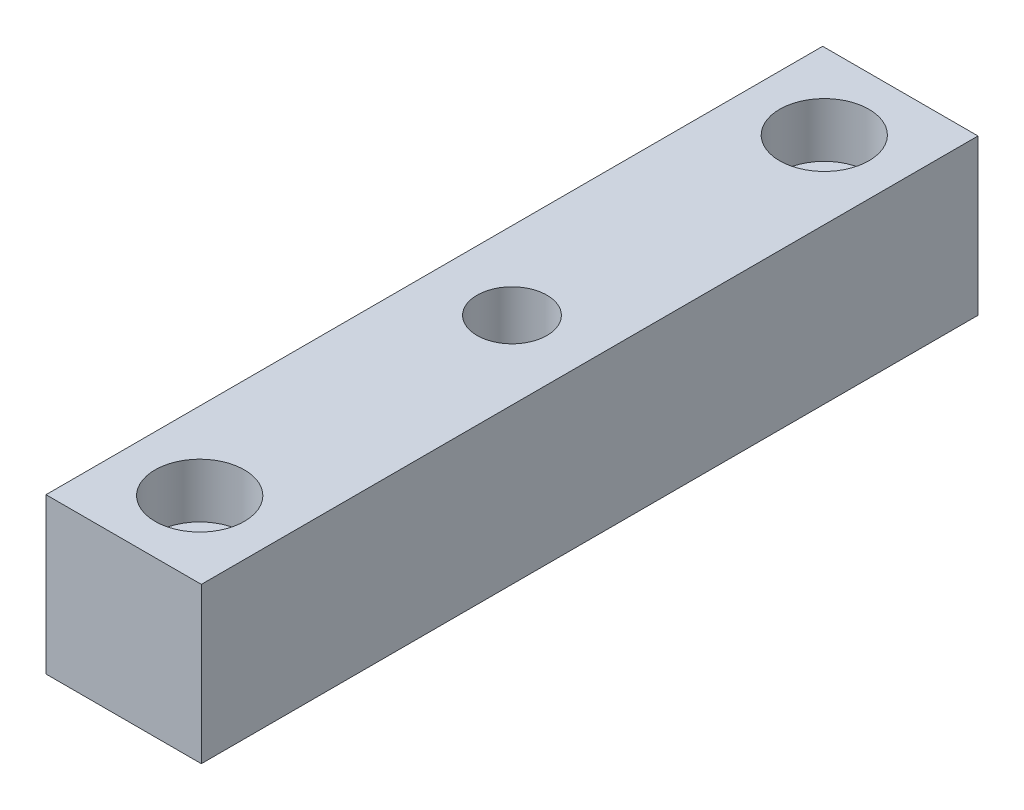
ISO-10303-21;
HEADER;
FILE_DESCRIPTION(('STEP AP214'),'2;1');
FILE_NAME('part.step','',(''),(''),'','','');
FILE_SCHEMA(('AUTOMOTIVE_DESIGN { 1 0 10303 214 1 1 1 1 }'));
ENDSEC;
DATA;
#1=APPLICATION_CONTEXT('core data for automotive mechanical design processes');
#2=APPLICATION_PROTOCOL_DEFINITION('international standard','automotive_design',2000,#1);
#3=PRODUCT_CONTEXT('',#1,'mechanical');
#4=PRODUCT('Part','Part','',(#3));
#5=PRODUCT_RELATED_PRODUCT_CATEGORY('part','',(#4));
#6=PRODUCT_DEFINITION_FORMATION('','',#4);
#7=PRODUCT_DEFINITION_CONTEXT('part definition',#1,'design');
#8=PRODUCT_DEFINITION('design','',#6,#7);
#9=PRODUCT_DEFINITION_SHAPE('','',#8);
#10=(LENGTH_UNIT() NAMED_UNIT(*) SI_UNIT(.MILLI.,.METRE.));
#11=(NAMED_UNIT(*) PLANE_ANGLE_UNIT() SI_UNIT($,.RADIAN.));
#12=(NAMED_UNIT(*) SI_UNIT($,.STERADIAN.) SOLID_ANGLE_UNIT());
#13=UNCERTAINTY_MEASURE_WITH_UNIT(LENGTH_MEASURE(1.E-05),#10,'distance_accuracy_value','');
#14=(GEOMETRIC_REPRESENTATION_CONTEXT(3) GLOBAL_UNCERTAINTY_ASSIGNED_CONTEXT((#13)) GLOBAL_UNIT_ASSIGNED_CONTEXT((#10,
#11,#12)) REPRESENTATION_CONTEXT('',''));
#15=CARTESIAN_POINT('',(0.,0.,0.));
#16=DIRECTION('',(0.,0.,1.));
#17=DIRECTION('',(1.,0.,0.));
#18=AXIS2_PLACEMENT_3D('',#15,#16,#17);
#19=CARTESIAN_POINT('',(-20.,20.,100.));
#20=DIRECTION('',(1.,0.,0.));
#21=DIRECTION('',(0.,1.,0.));
#22=AXIS2_PLACEMENT_3D('',#19,#20,#21);
#23=PLANE('',#22);
#24=DIRECTION('',(0.,-1.,0.));
#25=VECTOR('',#24,1.);
#26=CARTESIAN_POINT('',(-20.,20.,-100.));
#27=LINE('',#26,#25);
#28=CARTESIAN_POINT('',(-20.,20.,-100.));
#29=VERTEX_POINT('',#28);
#30=CARTESIAN_POINT('',(-20.,-20.,-100.));
#31=VERTEX_POINT('',#30);
#32=EDGE_CURVE('E90',#29,#31,#27,.T.);
#33=ORIENTED_EDGE('',*,*,#32,.T.);
#34=DIRECTION('',(0.,0.,-1.));
#35=VECTOR('',#34,1.);
#36=CARTESIAN_POINT('',(-20.,-20.,100.));
#37=LINE('',#36,#35);
#38=CARTESIAN_POINT('',(-20.,-20.,100.));
#39=VERTEX_POINT('',#38);
#40=EDGE_CURVE('E11',#39,#31,#37,.T.);
#41=ORIENTED_EDGE('',*,*,#40,.F.);
#42=DIRECTION('',(0.,-1.,0.));
#43=VECTOR('',#42,1.);
#44=CARTESIAN_POINT('',(-20.,20.,100.));
#45=LINE('',#44,#43);
#46=CARTESIAN_POINT('',(-20.,20.,100.));
#47=VERTEX_POINT('',#46);
#48=EDGE_CURVE('E105',#47,#39,#45,.T.);
#49=ORIENTED_EDGE('',*,*,#48,.F.);
#50=DIRECTION('',(0.,0.,-1.));
#51=VECTOR('',#50,1.);
#52=CARTESIAN_POINT('',(-20.,20.,100.));
#53=LINE('',#52,#51);
#54=EDGE_CURVE('E111',#47,#29,#53,.T.);
#55=ORIENTED_EDGE('',*,*,#54,.T.);
#56=EDGE_LOOP('',(#33,#41,#49,#55));
#57=FACE_BOUND('',#56,.T.);
#58=ADVANCED_FACE('F35',(#57),#23,.F.);
#59=CARTESIAN_POINT('',(-20.,-20.,100.));
#60=DIRECTION('',(0.,1.,0.));
#61=DIRECTION('',(0.,0.,1.));
#62=AXIS2_PLACEMENT_3D('',#59,#60,#61);
#63=PLANE('',#62);
#64=CARTESIAN_POINT('',(0.,-20.,80.415));
#65=DIRECTION('',(0.,1.,0.));
#66=DIRECTION('',(0.,0.,1.));
#67=AXIS2_PLACEMENT_3D('',#64,#65,#66);
#68=CIRCLE('',#67,7.99999999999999);
#69=CARTESIAN_POINT('',(0.,-20.,88.415));
#70=VERTEX_POINT('',#69);
#71=EDGE_CURVE('E178',#70,#70,#68,.T.);
#72=ORIENTED_EDGE('',*,*,#71,.T.);
#73=EDGE_LOOP('',(#72));
#74=FACE_BOUND('',#73,.T.);
#75=CARTESIAN_POINT('',(0.,-20.,-80.415));
#76=DIRECTION('',(0.,1.,0.));
#77=DIRECTION('',(0.,0.,1.));
#78=AXIS2_PLACEMENT_3D('',#75,#76,#77);
#79=CIRCLE('',#78,7.99999999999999);
#80=CARTESIAN_POINT('',(0.,-20.,-72.415));
#81=VERTEX_POINT('',#80);
#82=EDGE_CURVE('E191',#81,#81,#79,.T.);
#83=ORIENTED_EDGE('',*,*,#82,.T.);
#84=EDGE_LOOP('',(#83));
#85=FACE_BOUND('',#84,.T.);
#86=DIRECTION('',(1.,0.,0.));
#87=VECTOR('',#86,1.);
#88=CARTESIAN_POINT('',(-20.,-20.,-100.));
#89=LINE('',#88,#87);
#90=CARTESIAN_POINT('',(20.,-20.,-100.));
#91=VERTEX_POINT('',#90);
#92=EDGE_CURVE('E99',#31,#91,#89,.T.);
#93=ORIENTED_EDGE('',*,*,#92,.T.);
#94=DIRECTION('',(0.,0.,-1.));
#95=VECTOR('',#94,1.);
#96=CARTESIAN_POINT('',(20.,-20.,100.));
#97=LINE('',#96,#95);
#98=CARTESIAN_POINT('',(20.,-20.,100.));
#99=VERTEX_POINT('',#98);
#100=EDGE_CURVE('E42',#99,#91,#97,.T.);
#101=ORIENTED_EDGE('',*,*,#100,.F.);
#102=DIRECTION('',(1.,0.,0.));
#103=VECTOR('',#102,1.);
#104=CARTESIAN_POINT('',(-20.,-20.,100.));
#105=LINE('',#104,#103);
#106=EDGE_CURVE('E107',#39,#99,#105,.T.);
#107=ORIENTED_EDGE('',*,*,#106,.F.);
#108=ORIENTED_EDGE('',*,*,#40,.T.);
#109=EDGE_LOOP('',(#93,#101,#107,#108));
#110=FACE_BOUND('',#109,.T.);
#111=ADVANCED_FACE('F132',(#74,#85,#110),#63,.F.);
#112=CARTESIAN_POINT('',(20.,20.,100.));
#113=DIRECTION('',(-1.,0.,0.));
#114=DIRECTION('',(0.,-1.,0.));
#115=AXIS2_PLACEMENT_3D('',#112,#113,#114);
#116=PLANE('',#115);
#117=DIRECTION('',(0.,1.,0.));
#118=VECTOR('',#117,1.);
#119=CARTESIAN_POINT('',(20.,20.,-100.));
#120=LINE('',#119,#118);
#121=CARTESIAN_POINT('',(20.,20.,-100.));
#122=VERTEX_POINT('',#121);
#123=EDGE_CURVE('E101',#91,#122,#120,.T.);
#124=ORIENTED_EDGE('',*,*,#123,.T.);
#125=DIRECTION('',(0.,0.,-1.));
#126=VECTOR('',#125,1.);
#127=CARTESIAN_POINT('',(20.,20.,100.));
#128=LINE('',#127,#126);
#129=CARTESIAN_POINT('',(20.,20.,100.));
#130=VERTEX_POINT('',#129);
#131=EDGE_CURVE('E114',#130,#122,#128,.T.);
#132=ORIENTED_EDGE('',*,*,#131,.F.);
#133=DIRECTION('',(0.,1.,0.));
#134=VECTOR('',#133,1.);
#135=CARTESIAN_POINT('',(20.,20.,100.));
#136=LINE('',#135,#134);
#137=EDGE_CURVE('E54',#99,#130,#136,.T.);
#138=ORIENTED_EDGE('',*,*,#137,.F.);
#139=ORIENTED_EDGE('',*,*,#100,.T.);
#140=EDGE_LOOP('',(#124,#132,#138,#139));
#141=FACE_BOUND('',#140,.T.);
#142=ADVANCED_FACE('F120',(#141),#116,.F.);
#143=CARTESIAN_POINT('',(-20.,20.,100.));
#144=DIRECTION('',(0.,-1.,0.));
#145=DIRECTION('',(0.,0.,-1.));
#146=AXIS2_PLACEMENT_3D('',#143,#144,#145);
#147=PLANE('',#146);
#148=CARTESIAN_POINT('',(0.,20.,80.415));
#149=DIRECTION('',(0.,1.,0.));
#150=DIRECTION('',(0.,0.,1.));
#151=AXIS2_PLACEMENT_3D('',#148,#149,#150);
#152=CIRCLE('',#151,11.5);
#153=CARTESIAN_POINT('',(0.,20.,91.915));
#154=VERTEX_POINT('',#153);
#155=EDGE_CURVE('E185',#154,#154,#152,.T.);
#156=ORIENTED_EDGE('',*,*,#155,.F.);
#157=EDGE_LOOP('',(#156));
#158=FACE_BOUND('',#157,.T.);
#159=CARTESIAN_POINT('',(0.,20.,-80.415));
#160=DIRECTION('',(0.,1.,0.));
#161=DIRECTION('',(0.,0.,1.));
#162=AXIS2_PLACEMENT_3D('',#159,#160,#161);
#163=CIRCLE('',#162,11.5);
#164=CARTESIAN_POINT('',(0.,20.,-68.915));
#165=VERTEX_POINT('',#164);
#166=EDGE_CURVE('E87',#165,#165,#163,.T.);
#167=ORIENTED_EDGE('',*,*,#166,.F.);
#168=EDGE_LOOP('',(#167));
#169=FACE_BOUND('',#168,.T.);
#170=CARTESIAN_POINT('',(0.,20.,0.));
#171=DIRECTION('',(0.,1.,0.));
#172=DIRECTION('',(0.,0.,1.));
#173=AXIS2_PLACEMENT_3D('',#170,#171,#172);
#174=CIRCLE('',#173,9.);
#175=CARTESIAN_POINT('',(0.,20.,9.));
#176=VERTEX_POINT('',#175);
#177=EDGE_CURVE('E86',#176,#176,#174,.T.);
#178=ORIENTED_EDGE('',*,*,#177,.F.);
#179=EDGE_LOOP('',(#178));
#180=FACE_BOUND('',#179,.T.);
#181=DIRECTION('',(-1.,0.,0.));
#182=VECTOR('',#181,1.);
#183=CARTESIAN_POINT('',(-20.,20.,-100.));
#184=LINE('',#183,#182);
#185=EDGE_CURVE('E103',#122,#29,#184,.T.);
#186=ORIENTED_EDGE('',*,*,#185,.T.);
#187=ORIENTED_EDGE('',*,*,#54,.F.);
#188=DIRECTION('',(-1.,0.,0.));
#189=VECTOR('',#188,1.);
#190=CARTESIAN_POINT('',(-20.,20.,100.));
#191=LINE('',#190,#189);
#192=EDGE_CURVE('E49',#130,#47,#191,.T.);
#193=ORIENTED_EDGE('',*,*,#192,.F.);
#194=ORIENTED_EDGE('',*,*,#131,.T.);
#195=EDGE_LOOP('',(#186,#187,#193,#194));
#196=FACE_BOUND('',#195,.T.);
#197=ADVANCED_FACE('F127',(#158,#169,#180,#196),#147,.F.);
#198=CARTESIAN_POINT('',(-20.,-20.,100.));
#199=DIRECTION('',(0.,0.,1.));
#200=DIRECTION('',(1.,0.,0.));
#201=AXIS2_PLACEMENT_3D('',#198,#199,#200);
#202=PLANE('',#201);
#203=ORIENTED_EDGE('',*,*,#48,.T.);
#204=ORIENTED_EDGE('',*,*,#106,.T.);
#205=ORIENTED_EDGE('',*,*,#137,.T.);
#206=ORIENTED_EDGE('',*,*,#192,.T.);
#207=EDGE_LOOP('',(#203,#204,#205,#206));
#208=FACE_BOUND('',#207,.T.);
#209=ADVANCED_FACE('F131',(#208),#202,.T.);
#210=CARTESIAN_POINT('',(-20.,-20.,-100.));
#211=DIRECTION('',(0.,0.,1.));
#212=DIRECTION('',(1.,0.,0.));
#213=AXIS2_PLACEMENT_3D('',#210,#211,#212);
#214=PLANE('',#213);
#215=ORIENTED_EDGE('',*,*,#32,.F.);
#216=ORIENTED_EDGE('',*,*,#185,.F.);
#217=ORIENTED_EDGE('',*,*,#123,.F.);
#218=ORIENTED_EDGE('',*,*,#92,.F.);
#219=EDGE_LOOP('',(#215,#216,#217,#218));
#220=FACE_BOUND('',#219,.T.);
#221=ADVANCED_FACE('F125',(#220),#214,.F.);
#222=CARTESIAN_POINT('',(0.,20.,0.));
#223=DIRECTION('',(0.,1.,0.));
#224=DIRECTION('',(0.,0.,1.));
#225=AXIS2_PLACEMENT_3D('',#222,#223,#224);
#226=CYLINDRICAL_SURFACE('',#225,9.);
#227=CARTESIAN_POINT('',(0.,-13.,0.));
#228=DIRECTION('',(0.,1.,0.));
#229=DIRECTION('',(0.,0.,1.));
#230=AXIS2_PLACEMENT_3D('',#227,#228,#229);
#231=CIRCLE('',#230,8.99999999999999);
#232=CARTESIAN_POINT('',(0.,-13.,8.99999999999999));
#233=VERTEX_POINT('',#232);
#234=EDGE_CURVE('E84',#233,#233,#231,.T.);
#235=ORIENTED_EDGE('',*,*,#234,.F.);
#236=EDGE_LOOP('',(#235));
#237=FACE_BOUND('',#236,.T.);
#238=ORIENTED_EDGE('',*,*,#177,.T.);
#239=EDGE_LOOP('',(#238));
#240=FACE_BOUND('',#239,.T.);
#241=ADVANCED_FACE('F80',(#237,#240),#226,.F.);
#242=CARTESIAN_POINT('',(0.,-13.,0.));
#243=DIRECTION('',(0.,1.,0.));
#244=DIRECTION('',(0.,0.,1.));
#245=AXIS2_PLACEMENT_3D('',#242,#243,#244);
#246=CONICAL_SURFACE('',#245,8.99999999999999,1.0471975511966);
#247=CARTESIAN_POINT('',(0.,-18.1961524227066,0.));
#248=VERTEX_POINT('',#247);
#249=VERTEX_LOOP('',#248);
#250=FACE_BOUND('',#249,.T.);
#251=ORIENTED_EDGE('',*,*,#234,.T.);
#252=EDGE_LOOP('',(#251));
#253=FACE_BOUND('',#252,.T.);
#254=ADVANCED_FACE('F76',(#250,#253),#246,.F.);
#255=CARTESIAN_POINT('',(0.,20.,-80.415));
#256=DIRECTION('',(0.,1.,0.));
#257=DIRECTION('',(0.,0.,1.));
#258=AXIS2_PLACEMENT_3D('',#255,#256,#257);
#259=CYLINDRICAL_SURFACE('',#258,11.5);
#260=CARTESIAN_POINT('',(0.,6.,-80.415));
#261=DIRECTION('',(0.,1.,0.));
#262=DIRECTION('',(0.,0.,1.));
#263=AXIS2_PLACEMENT_3D('',#260,#261,#262);
#264=CIRCLE('',#263,11.5);
#265=CARTESIAN_POINT('',(0.,6.,-68.915));
#266=VERTEX_POINT('',#265);
#267=EDGE_CURVE('E93',#266,#266,#264,.T.);
#268=ORIENTED_EDGE('',*,*,#267,.F.);
#269=EDGE_LOOP('',(#268));
#270=FACE_BOUND('',#269,.T.);
#271=ORIENTED_EDGE('',*,*,#166,.T.);
#272=EDGE_LOOP('',(#271));
#273=FACE_BOUND('',#272,.T.);
#274=ADVANCED_FACE('F79',(#270,#273),#259,.F.);
#275=CARTESIAN_POINT('',(8.,6.,-80.415));
#276=DIRECTION('',(0.,-1.,0.));
#277=DIRECTION('',(0.,0.,-1.));
#278=AXIS2_PLACEMENT_3D('',#275,#276,#277);
#279=PLANE('',#278);
#280=CARTESIAN_POINT('',(0.,6.,-80.415));
#281=DIRECTION('',(0.,1.,0.));
#282=DIRECTION('',(0.,0.,1.));
#283=AXIS2_PLACEMENT_3D('',#280,#281,#282);
#284=CIRCLE('',#283,8.);
#285=CARTESIAN_POINT('',(0.,6.,-72.415));
#286=VERTEX_POINT('',#285);
#287=EDGE_CURVE('E194',#286,#286,#284,.T.);
#288=ORIENTED_EDGE('',*,*,#287,.F.);
#289=EDGE_LOOP('',(#288));
#290=FACE_BOUND('',#289,.T.);
#291=ORIENTED_EDGE('',*,*,#267,.T.);
#292=EDGE_LOOP('',(#291));
#293=FACE_BOUND('',#292,.T.);
#294=ADVANCED_FACE('F154',(#290,#293),#279,.F.);
#295=CARTESIAN_POINT('',(0.,20.,-80.415));
#296=DIRECTION('',(0.,1.,0.));
#297=DIRECTION('',(0.,0.,1.));
#298=AXIS2_PLACEMENT_3D('',#295,#296,#297);
#299=CYLINDRICAL_SURFACE('',#298,8.);
#300=ORIENTED_EDGE('',*,*,#82,.F.);
#301=EDGE_LOOP('',(#300));
#302=FACE_BOUND('',#301,.T.);
#303=ORIENTED_EDGE('',*,*,#287,.T.);
#304=EDGE_LOOP('',(#303));
#305=FACE_BOUND('',#304,.T.);
#306=ADVANCED_FACE('F158',(#302,#305),#299,.F.);
#307=CARTESIAN_POINT('',(0.,20.,80.415));
#308=DIRECTION('',(0.,1.,0.));
#309=DIRECTION('',(0.,0.,1.));
#310=AXIS2_PLACEMENT_3D('',#307,#308,#309);
#311=CYLINDRICAL_SURFACE('',#310,11.5);
#312=CARTESIAN_POINT('',(0.,6.,80.415));
#313=DIRECTION('',(0.,1.,0.));
#314=DIRECTION('',(0.,0.,1.));
#315=AXIS2_PLACEMENT_3D('',#312,#313,#314);
#316=CIRCLE('',#315,11.5);
#317=CARTESIAN_POINT('',(0.,6.,91.915));
#318=VERTEX_POINT('',#317);
#319=EDGE_CURVE('E182',#318,#318,#316,.T.);
#320=ORIENTED_EDGE('',*,*,#319,.F.);
#321=EDGE_LOOP('',(#320));
#322=FACE_BOUND('',#321,.T.);
#323=ORIENTED_EDGE('',*,*,#155,.T.);
#324=EDGE_LOOP('',(#323));
#325=FACE_BOUND('',#324,.T.);
#326=ADVANCED_FACE('F162',(#322,#325),#311,.F.);
#327=CARTESIAN_POINT('',(8.,6.,80.415));
#328=DIRECTION('',(0.,-1.,0.));
#329=DIRECTION('',(0.,0.,-1.));
#330=AXIS2_PLACEMENT_3D('',#327,#328,#329);
#331=PLANE('',#330);
#332=CARTESIAN_POINT('',(0.,6.,80.415));
#333=DIRECTION('',(0.,1.,0.));
#334=DIRECTION('',(0.,0.,1.));
#335=AXIS2_PLACEMENT_3D('',#332,#333,#334);
#336=CIRCLE('',#335,8.);
#337=CARTESIAN_POINT('',(0.,6.,88.415));
#338=VERTEX_POINT('',#337);
#339=EDGE_CURVE('E181',#338,#338,#336,.T.);
#340=ORIENTED_EDGE('',*,*,#339,.F.);
#341=EDGE_LOOP('',(#340));
#342=FACE_BOUND('',#341,.T.);
#343=ORIENTED_EDGE('',*,*,#319,.T.);
#344=EDGE_LOOP('',(#343));
#345=FACE_BOUND('',#344,.T.);
#346=ADVANCED_FACE('F166',(#342,#345),#331,.F.);
#347=CARTESIAN_POINT('',(0.,20.,80.415));
#348=DIRECTION('',(0.,1.,0.));
#349=DIRECTION('',(0.,0.,1.));
#350=AXIS2_PLACEMENT_3D('',#347,#348,#349);
#351=CYLINDRICAL_SURFACE('',#350,8.);
#352=ORIENTED_EDGE('',*,*,#71,.F.);
#353=EDGE_LOOP('',(#352));
#354=FACE_BOUND('',#353,.T.);
#355=ORIENTED_EDGE('',*,*,#339,.T.);
#356=EDGE_LOOP('',(#355));
#357=FACE_BOUND('',#356,.T.);
#358=ADVANCED_FACE('F170',(#354,#357),#351,.F.);
#359=CLOSED_SHELL('',(#58,#111,#142,#197,#209,#221,#241,#254,#274,#294,#306,#326,#346,#358));
#360=MANIFOLD_SOLID_BREP('B2',#359);
#361=ADVANCED_BREP_SHAPE_REPRESENTATION('',(#18,#360),#14);
#362=SHAPE_DEFINITION_REPRESENTATION(#9,#361);
ENDSEC;
END-ISO-10303-21;
